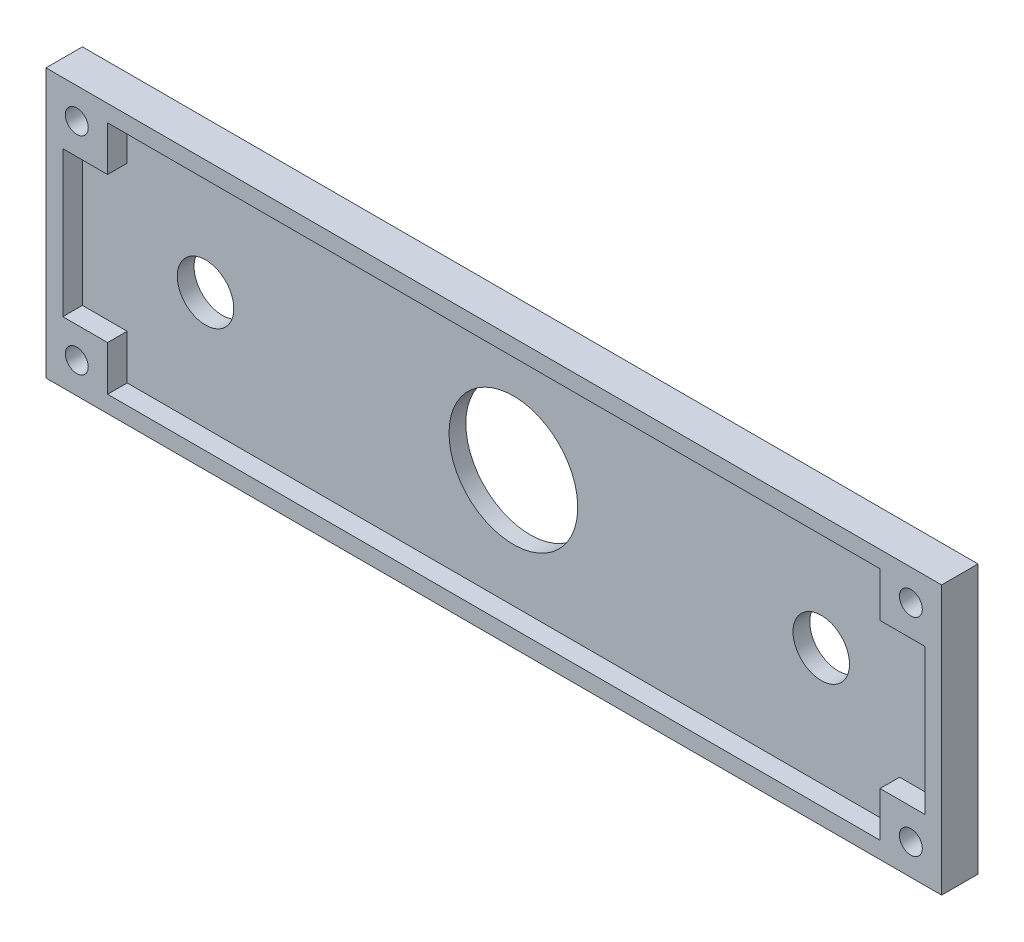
ISO-10303-21;
HEADER;
FILE_DESCRIPTION(('STEP AP214'),'2;1');
FILE_NAME('part.step','',(''),(''),'','','');
FILE_SCHEMA(('AUTOMOTIVE_DESIGN { 1 0 10303 214 1 1 1 1 }'));
ENDSEC;
DATA;
#1=APPLICATION_CONTEXT('core data for automotive mechanical design processes');
#2=APPLICATION_PROTOCOL_DEFINITION('international standard','automotive_design',2000,#1);
#3=PRODUCT_CONTEXT('',#1,'mechanical');
#4=PRODUCT('Part','Part','',(#3));
#5=PRODUCT_RELATED_PRODUCT_CATEGORY('part','',(#4));
#6=PRODUCT_DEFINITION_FORMATION('','',#4);
#7=PRODUCT_DEFINITION_CONTEXT('part definition',#1,'design');
#8=PRODUCT_DEFINITION('design','',#6,#7);
#9=PRODUCT_DEFINITION_SHAPE('','',#8);
#10=(LENGTH_UNIT() NAMED_UNIT(*) SI_UNIT(.MILLI.,.METRE.));
#11=(NAMED_UNIT(*) PLANE_ANGLE_UNIT() SI_UNIT($,.RADIAN.));
#12=(NAMED_UNIT(*) SI_UNIT($,.STERADIAN.) SOLID_ANGLE_UNIT());
#13=UNCERTAINTY_MEASURE_WITH_UNIT(LENGTH_MEASURE(1.E-05),#10,'distance_accuracy_value','');
#14=(GEOMETRIC_REPRESENTATION_CONTEXT(3) GLOBAL_UNCERTAINTY_ASSIGNED_CONTEXT((#13)) GLOBAL_UNIT_ASSIGNED_CONTEXT((#10,
#11,#12)) REPRESENTATION_CONTEXT('',''));
#15=CARTESIAN_POINT('',(0.,0.,0.));
#16=DIRECTION('',(0.,0.,1.));
#17=DIRECTION('',(1.,0.,0.));
#18=AXIS2_PLACEMENT_3D('',#15,#16,#17);
#19=CARTESIAN_POINT('',(73.4437253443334,18.5,10.));
#20=DIRECTION('',(0.,0.,-1.));
#21=DIRECTION('',(-1.,0.,0.));
#22=AXIS2_PLACEMENT_3D('',#19,#20,#21);
#23=CYLINDRICAL_SURFACE('',#22,2.04999999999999);
#24=CARTESIAN_POINT('',(73.4437253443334,18.5,6.5));
#25=DIRECTION('',(0.,0.,1.));
#26=DIRECTION('',(1.,0.,0.));
#27=AXIS2_PLACEMENT_3D('',#24,#25,#26);
#28=CIRCLE('',#27,2.04999999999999);
#29=CARTESIAN_POINT('',(75.4937253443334,18.5,6.5));
#30=VERTEX_POINT('',#29);
#31=EDGE_CURVE('E303',#30,#30,#28,.T.);
#32=ORIENTED_EDGE('',*,*,#31,.T.);
#33=EDGE_LOOP('',(#32));
#34=FACE_BOUND('',#33,.T.);
#35=CARTESIAN_POINT('',(73.4437253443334,18.5,3.5));
#36=DIRECTION('',(0.,0.,-1.));
#37=DIRECTION('',(-1.,0.,0.));
#38=AXIS2_PLACEMENT_3D('',#35,#36,#37);
#39=CIRCLE('',#38,2.04999999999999);
#40=CARTESIAN_POINT('',(71.3937253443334,18.5,3.5));
#41=VERTEX_POINT('',#40);
#42=EDGE_CURVE('E300',#41,#41,#39,.F.);
#43=ORIENTED_EDGE('',*,*,#42,.F.);
#44=EDGE_LOOP('',(#43));
#45=FACE_BOUND('',#44,.T.);
#46=ADVANCED_FACE('F41',(#34,#45),#23,.F.);
#47=CARTESIAN_POINT('',(-75.5562746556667,-18.5,10.));
#48=DIRECTION('',(0.,0.,-1.));
#49=DIRECTION('',(-1.,0.,0.));
#50=AXIS2_PLACEMENT_3D('',#47,#48,#49);
#51=CYLINDRICAL_SURFACE('',#50,2.04999999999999);
#52=CARTESIAN_POINT('',(-75.5562746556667,-18.5,6.5));
#53=DIRECTION('',(0.,0.,1.));
#54=DIRECTION('',(1.,0.,0.));
#55=AXIS2_PLACEMENT_3D('',#52,#53,#54);
#56=CIRCLE('',#55,2.04999999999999);
#57=CARTESIAN_POINT('',(-73.5062746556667,-18.5,6.5));
#58=VERTEX_POINT('',#57);
#59=EDGE_CURVE('E335',#58,#58,#56,.T.);
#60=ORIENTED_EDGE('',*,*,#59,.T.);
#61=EDGE_LOOP('',(#60));
#62=FACE_BOUND('',#61,.T.);
#63=CARTESIAN_POINT('',(-75.5562746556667,-18.5,3.5));
#64=DIRECTION('',(0.,0.,-1.));
#65=DIRECTION('',(-1.,0.,0.));
#66=AXIS2_PLACEMENT_3D('',#63,#64,#65);
#67=CIRCLE('',#66,2.04999999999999);
#68=CARTESIAN_POINT('',(-77.6062746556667,-18.5,3.5));
#69=VERTEX_POINT('',#68);
#70=EDGE_CURVE('E293',#69,#69,#67,.F.);
#71=ORIENTED_EDGE('',*,*,#70,.F.);
#72=EDGE_LOOP('',(#71));
#73=FACE_BOUND('',#72,.T.);
#74=ADVANCED_FACE('F379',(#62,#73),#51,.F.);
#75=CARTESIAN_POINT('',(-81.0562746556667,24.,6.5));
#76=DIRECTION('',(1.,0.,0.));
#77=DIRECTION('',(0.,0.,-1.));
#78=AXIS2_PLACEMENT_3D('',#75,#76,#77);
#79=PLANE('',#78);
#80=DIRECTION('',(0.,-1.,0.));
#81=VECTOR('',#80,1.);
#82=CARTESIAN_POINT('',(-81.0562746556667,24.,0.));
#83=LINE('',#82,#81);
#84=CARTESIAN_POINT('',(-81.0562746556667,24.,0.));
#85=VERTEX_POINT('',#84);
#86=CARTESIAN_POINT('',(-81.0562746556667,-24.,0.));
#87=VERTEX_POINT('',#86);
#88=EDGE_CURVE('E251',#85,#87,#83,.T.);
#89=ORIENTED_EDGE('',*,*,#88,.T.);
#90=DIRECTION('',(0.,0.,-1.));
#91=VECTOR('',#90,1.);
#92=CARTESIAN_POINT('',(-81.0562746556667,-24.,6.5));
#93=LINE('',#92,#91);
#94=CARTESIAN_POINT('',(-81.0562746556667,-24.,6.5));
#95=VERTEX_POINT('',#94);
#96=EDGE_CURVE('E11',#95,#87,#93,.T.);
#97=ORIENTED_EDGE('',*,*,#96,.F.);
#98=DIRECTION('',(0.,-1.,0.));
#99=VECTOR('',#98,1.);
#100=CARTESIAN_POINT('',(-81.0562746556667,24.,6.5));
#101=LINE('',#100,#99);
#102=CARTESIAN_POINT('',(-81.0562746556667,24.,6.5));
#103=VERTEX_POINT('',#102);
#104=EDGE_CURVE('E271',#103,#95,#101,.T.);
#105=ORIENTED_EDGE('',*,*,#104,.F.);
#106=DIRECTION('',(0.,0.,-1.));
#107=VECTOR('',#106,1.);
#108=CARTESIAN_POINT('',(-81.0562746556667,24.,6.5));
#109=LINE('',#108,#107);
#110=EDGE_CURVE('E277',#103,#85,#109,.T.);
#111=ORIENTED_EDGE('',*,*,#110,.T.);
#112=EDGE_LOOP('',(#89,#97,#105,#111));
#113=FACE_BOUND('',#112,.T.);
#114=ADVANCED_FACE('F43',(#113),#79,.F.);
#115=CARTESIAN_POINT('',(-81.0562746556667,-24.,6.5));
#116=DIRECTION('',(0.,1.,0.));
#117=DIRECTION('',(0.,0.,1.));
#118=AXIS2_PLACEMENT_3D('',#115,#116,#117);
#119=PLANE('',#118);
#120=DIRECTION('',(1.,0.,0.));
#121=VECTOR('',#120,1.);
#122=CARTESIAN_POINT('',(-81.0562746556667,-24.,0.));
#123=LINE('',#122,#121);
#124=CARTESIAN_POINT('',(78.9437253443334,-24.,0.));
#125=VERTEX_POINT('',#124);
#126=EDGE_CURVE('E280',#87,#125,#123,.T.);
#127=ORIENTED_EDGE('',*,*,#126,.T.);
#128=DIRECTION('',(0.,0.,-1.));
#129=VECTOR('',#128,1.);
#130=CARTESIAN_POINT('',(78.9437253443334,-24.,6.5));
#131=LINE('',#130,#129);
#132=CARTESIAN_POINT('',(78.9437253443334,-24.,6.5));
#133=VERTEX_POINT('',#132);
#134=EDGE_CURVE('E50',#133,#125,#131,.T.);
#135=ORIENTED_EDGE('',*,*,#134,.F.);
#136=DIRECTION('',(1.,0.,0.));
#137=VECTOR('',#136,1.);
#138=CARTESIAN_POINT('',(-81.0562746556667,-24.,6.5));
#139=LINE('',#138,#137);
#140=EDGE_CURVE('E95',#95,#133,#139,.T.);
#141=ORIENTED_EDGE('',*,*,#140,.F.);
#142=ORIENTED_EDGE('',*,*,#96,.T.);
#143=EDGE_LOOP('',(#127,#135,#141,#142));
#144=FACE_BOUND('',#143,.T.);
#145=ADVANCED_FACE('F360',(#144),#119,.F.);
#146=CARTESIAN_POINT('',(78.9437253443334,24.,6.5));
#147=DIRECTION('',(-1.,0.,0.));
#148=DIRECTION('',(0.,0.,1.));
#149=AXIS2_PLACEMENT_3D('',#146,#147,#148);
#150=PLANE('',#149);
#151=DIRECTION('',(0.,1.,0.));
#152=VECTOR('',#151,1.);
#153=CARTESIAN_POINT('',(78.9437253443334,24.,0.));
#154=LINE('',#153,#152);
#155=CARTESIAN_POINT('',(78.9437253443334,24.,0.));
#156=VERTEX_POINT('',#155);
#157=EDGE_CURVE('E282',#125,#156,#154,.T.);
#158=ORIENTED_EDGE('',*,*,#157,.T.);
#159=DIRECTION('',(0.,0.,-1.));
#160=VECTOR('',#159,1.);
#161=CARTESIAN_POINT('',(78.9437253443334,24.,6.5));
#162=LINE('',#161,#160);
#163=CARTESIAN_POINT('',(78.9437253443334,24.,6.5));
#164=VERTEX_POINT('',#163);
#165=EDGE_CURVE('E286',#164,#156,#162,.T.);
#166=ORIENTED_EDGE('',*,*,#165,.F.);
#167=DIRECTION('',(0.,1.,0.));
#168=VECTOR('',#167,1.);
#169=CARTESIAN_POINT('',(78.9437253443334,24.,6.5));
#170=LINE('',#169,#168);
#171=EDGE_CURVE('E274',#133,#164,#170,.T.);
#172=ORIENTED_EDGE('',*,*,#171,.F.);
#173=ORIENTED_EDGE('',*,*,#134,.T.);
#174=EDGE_LOOP('',(#158,#166,#172,#173));
#175=FACE_BOUND('',#174,.T.);
#176=ADVANCED_FACE('F365',(#175),#150,.F.);
#177=CARTESIAN_POINT('',(-81.0562746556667,24.,6.5));
#178=DIRECTION('',(0.,-1.,0.));
#179=DIRECTION('',(0.,0.,-1.));
#180=AXIS2_PLACEMENT_3D('',#177,#178,#179);
#181=PLANE('',#180);
#182=DIRECTION('',(-1.,0.,0.));
#183=VECTOR('',#182,1.);
#184=CARTESIAN_POINT('',(-81.0562746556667,24.,0.));
#185=LINE('',#184,#183);
#186=EDGE_CURVE('E88',#156,#85,#185,.T.);
#187=ORIENTED_EDGE('',*,*,#186,.T.);
#188=ORIENTED_EDGE('',*,*,#110,.F.);
#189=DIRECTION('',(-1.,0.,0.));
#190=VECTOR('',#189,1.);
#191=CARTESIAN_POINT('',(-81.0562746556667,24.,6.5));
#192=LINE('',#191,#190);
#193=EDGE_CURVE('E67',#164,#103,#192,.T.);
#194=ORIENTED_EDGE('',*,*,#193,.F.);
#195=ORIENTED_EDGE('',*,*,#165,.T.);
#196=EDGE_LOOP('',(#187,#188,#194,#195));
#197=FACE_BOUND('',#196,.T.);
#198=ADVANCED_FACE('F348',(#197),#181,.F.);
#199=CARTESIAN_POINT('',(0.,0.,6.5));
#200=DIRECTION('',(0.,0.,1.));
#201=DIRECTION('',(1.,0.,0.));
#202=AXIS2_PLACEMENT_3D('',#199,#200,#201);
#203=PLANE('',#202);
#204=CARTESIAN_POINT('',(73.4437253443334,-18.5,6.5));
#205=DIRECTION('',(0.,0.,1.));
#206=DIRECTION('',(1.,0.,0.));
#207=AXIS2_PLACEMENT_3D('',#204,#205,#206);
#208=CIRCLE('',#207,2.04999999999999);
#209=CARTESIAN_POINT('',(75.4937253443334,-18.5,6.5));
#210=VERTEX_POINT('',#209);
#211=EDGE_CURVE('E192',#210,#210,#208,.T.);
#212=ORIENTED_EDGE('',*,*,#211,.F.);
#213=EDGE_LOOP('',(#212));
#214=FACE_BOUND('',#213,.T.);
#215=ORIENTED_EDGE('',*,*,#59,.F.);
#216=EDGE_LOOP('',(#215));
#217=FACE_BOUND('',#216,.T.);
#218=CARTESIAN_POINT('',(-75.5562746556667,18.5,6.5));
#219=DIRECTION('',(0.,0.,1.));
#220=DIRECTION('',(1.,0.,0.));
#221=AXIS2_PLACEMENT_3D('',#218,#219,#220);
#222=CIRCLE('',#221,2.04999999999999);
#223=CARTESIAN_POINT('',(-73.5062746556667,18.5,6.5));
#224=VERTEX_POINT('',#223);
#225=EDGE_CURVE('E333',#224,#224,#222,.T.);
#226=ORIENTED_EDGE('',*,*,#225,.F.);
#227=EDGE_LOOP('',(#226));
#228=FACE_BOUND('',#227,.T.);
#229=ORIENTED_EDGE('',*,*,#31,.F.);
#230=EDGE_LOOP('',(#229));
#231=FACE_BOUND('',#230,.T.);
#232=DIRECTION('',(0.,-1.,0.));
#233=VECTOR('',#232,1.);
#234=CARTESIAN_POINT('',(-70.0562746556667,21.,6.5));
#235=LINE('',#234,#233);
#236=CARTESIAN_POINT('',(-70.0562746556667,21.,6.5));
#237=VERTEX_POINT('',#236);
#238=CARTESIAN_POINT('',(-70.0562746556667,13.,6.5));
#239=VERTEX_POINT('',#238);
#240=EDGE_CURVE('E58',#237,#239,#235,.T.);
#241=ORIENTED_EDGE('',*,*,#240,.F.);
#242=DIRECTION('',(-1.,0.,0.));
#243=VECTOR('',#242,1.);
#244=CARTESIAN_POINT('',(-70.0562746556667,21.,6.5));
#245=LINE('',#244,#243);
#246=CARTESIAN_POINT('',(67.9437253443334,21.,6.5));
#247=VERTEX_POINT('',#246);
#248=EDGE_CURVE('E186',#247,#237,#245,.T.);
#249=ORIENTED_EDGE('',*,*,#248,.F.);
#250=DIRECTION('',(0.,1.,0.));
#251=VECTOR('',#250,1.);
#252=CARTESIAN_POINT('',(67.9437253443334,21.,6.5));
#253=LINE('',#252,#251);
#254=CARTESIAN_POINT('',(67.9437253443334,13.,6.5));
#255=VERTEX_POINT('',#254);
#256=EDGE_CURVE('E189',#255,#247,#253,.T.);
#257=ORIENTED_EDGE('',*,*,#256,.F.);
#258=DIRECTION('',(-1.,0.,0.));
#259=VECTOR('',#258,1.);
#260=CARTESIAN_POINT('',(67.9437253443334,13.,6.5));
#261=LINE('',#260,#259);
#262=CARTESIAN_POINT('',(75.9437253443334,13.,6.5));
#263=VERTEX_POINT('',#262);
#264=EDGE_CURVE('E244',#263,#255,#261,.T.);
#265=ORIENTED_EDGE('',*,*,#264,.F.);
#266=DIRECTION('',(0.,1.,0.));
#267=VECTOR('',#266,1.);
#268=CARTESIAN_POINT('',(75.9437253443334,13.,6.5));
#269=LINE('',#268,#267);
#270=CARTESIAN_POINT('',(75.9437253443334,-13.,6.5));
#271=VERTEX_POINT('',#270);
#272=EDGE_CURVE('E241',#271,#263,#269,.T.);
#273=ORIENTED_EDGE('',*,*,#272,.F.);
#274=DIRECTION('',(1.,0.,0.));
#275=VECTOR('',#274,1.);
#276=CARTESIAN_POINT('',(67.9437253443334,-13.,6.5));
#277=LINE('',#276,#275);
#278=CARTESIAN_POINT('',(67.9437253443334,-13.,6.5));
#279=VERTEX_POINT('',#278);
#280=EDGE_CURVE('E238',#279,#271,#277,.T.);
#281=ORIENTED_EDGE('',*,*,#280,.F.);
#282=DIRECTION('',(0.,1.,0.));
#283=VECTOR('',#282,1.);
#284=CARTESIAN_POINT('',(67.9437253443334,-21.,6.5));
#285=LINE('',#284,#283);
#286=CARTESIAN_POINT('',(67.9437253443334,-21.,6.5));
#287=VERTEX_POINT('',#286);
#288=EDGE_CURVE('E235',#287,#279,#285,.T.);
#289=ORIENTED_EDGE('',*,*,#288,.F.);
#290=DIRECTION('',(1.,0.,0.));
#291=VECTOR('',#290,1.);
#292=CARTESIAN_POINT('',(-70.0562746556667,-21.,6.5));
#293=LINE('',#292,#291);
#294=CARTESIAN_POINT('',(-70.0562746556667,-21.,6.5));
#295=VERTEX_POINT('',#294);
#296=EDGE_CURVE('E232',#295,#287,#293,.T.);
#297=ORIENTED_EDGE('',*,*,#296,.F.);
#298=DIRECTION('',(0.,-1.,0.));
#299=VECTOR('',#298,1.);
#300=CARTESIAN_POINT('',(-70.0562746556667,-13.,6.5));
#301=LINE('',#300,#299);
#302=CARTESIAN_POINT('',(-70.0562746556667,-13.,6.5));
#303=VERTEX_POINT('',#302);
#304=EDGE_CURVE('E229',#303,#295,#301,.T.);
#305=ORIENTED_EDGE('',*,*,#304,.F.);
#306=DIRECTION('',(1.,0.,0.));
#307=VECTOR('',#306,1.);
#308=CARTESIAN_POINT('',(-78.0562746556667,-13.,6.5));
#309=LINE('',#308,#307);
#310=CARTESIAN_POINT('',(-78.0562746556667,-13.,6.5));
#311=VERTEX_POINT('',#310);
#312=EDGE_CURVE('E226',#311,#303,#309,.T.);
#313=ORIENTED_EDGE('',*,*,#312,.F.);
#314=DIRECTION('',(0.,-1.,0.));
#315=VECTOR('',#314,1.);
#316=CARTESIAN_POINT('',(-78.0562746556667,13.,6.5));
#317=LINE('',#316,#315);
#318=CARTESIAN_POINT('',(-78.0562746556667,13.,6.5));
#319=VERTEX_POINT('',#318);
#320=EDGE_CURVE('E223',#319,#311,#317,.T.);
#321=ORIENTED_EDGE('',*,*,#320,.F.);
#322=DIRECTION('',(-1.,0.,0.));
#323=VECTOR('',#322,1.);
#324=CARTESIAN_POINT('',(-70.0562746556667,13.,6.5));
#325=LINE('',#324,#323);
#326=EDGE_CURVE('E221',#239,#319,#325,.T.);
#327=ORIENTED_EDGE('',*,*,#326,.F.);
#328=EDGE_LOOP('',(#241,#249,#257,#265,#273,#281,#289,#297,#305,#313,#321,#327));
#329=FACE_BOUND('',#328,.T.);
#330=ORIENTED_EDGE('',*,*,#104,.T.);
#331=ORIENTED_EDGE('',*,*,#140,.T.);
#332=ORIENTED_EDGE('',*,*,#171,.T.);
#333=ORIENTED_EDGE('',*,*,#193,.T.);
#334=EDGE_LOOP('',(#330,#331,#332,#333));
#335=FACE_BOUND('',#334,.T.);
#336=ADVANCED_FACE('F344',(#214,#217,#228,#231,#329,#335),#203,.T.);
#337=CARTESIAN_POINT('',(0.,0.,0.));
#338=DIRECTION('',(0.,0.,1.));
#339=DIRECTION('',(1.,0.,0.));
#340=AXIS2_PLACEMENT_3D('',#337,#338,#339);
#341=PLANE('',#340);
#342=CARTESIAN_POINT('',(-56.0562746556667,0.,0.));
#343=DIRECTION('',(0.,0.,-1.));
#344=DIRECTION('',(1.,0.,0.));
#345=AXIS2_PLACEMENT_3D('',#342,#343,#344);
#346=CIRCLE('',#345,5.05);
#347=CARTESIAN_POINT('',(-51.0062746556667,0.,0.));
#348=VERTEX_POINT('',#347);
#349=EDGE_CURVE('E755',#348,#348,#346,.T.);
#350=ORIENTED_EDGE('',*,*,#349,.F.);
#351=EDGE_LOOP('',(#350));
#352=FACE_BOUND('',#351,.T.);
#353=CARTESIAN_POINT('',(53.9437253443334,0.,0.));
#354=DIRECTION('',(0.,0.,-1.));
#355=DIRECTION('',(-1.,0.,0.));
#356=AXIS2_PLACEMENT_3D('',#353,#354,#355);
#357=CIRCLE('',#356,5.05);
#358=CARTESIAN_POINT('',(48.8937253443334,0.,0.));
#359=VERTEX_POINT('',#358);
#360=EDGE_CURVE('E756',#359,#359,#357,.T.);
#361=ORIENTED_EDGE('',*,*,#360,.F.);
#362=EDGE_LOOP('',(#361));
#363=FACE_BOUND('',#362,.T.);
#364=CARTESIAN_POINT('',(-1.05627465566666,0.,0.));
#365=DIRECTION('',(0.,0.,-1.));
#366=DIRECTION('',(-1.,0.,0.));
#367=AXIS2_PLACEMENT_3D('',#364,#365,#366);
#368=CIRCLE('',#367,11.5);
#369=CARTESIAN_POINT('',(-12.5562746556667,0.,0.));
#370=VERTEX_POINT('',#369);
#371=EDGE_CURVE('E307',#370,#370,#368,.T.);
#372=ORIENTED_EDGE('',*,*,#371,.F.);
#373=EDGE_LOOP('',(#372));
#374=FACE_BOUND('',#373,.T.);
#375=CARTESIAN_POINT('',(73.4437253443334,-18.5,0.));
#376=DIRECTION('',(0.,0.,-1.));
#377=DIRECTION('',(1.,0.,0.));
#378=AXIS2_PLACEMENT_3D('',#375,#376,#377);
#379=CIRCLE('',#378,4.00000000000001);
#380=CARTESIAN_POINT('',(77.4437253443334,-18.5,0.));
#381=VERTEX_POINT('',#380);
#382=EDGE_CURVE('E316',#381,#381,#379,.T.);
#383=ORIENTED_EDGE('',*,*,#382,.F.);
#384=EDGE_LOOP('',(#383));
#385=FACE_BOUND('',#384,.T.);
#386=CARTESIAN_POINT('',(-75.5562746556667,-18.5,0.));
#387=DIRECTION('',(0.,0.,-1.));
#388=DIRECTION('',(-1.,0.,0.));
#389=AXIS2_PLACEMENT_3D('',#386,#387,#388);
#390=CIRCLE('',#389,4.00000000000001);
#391=CARTESIAN_POINT('',(-79.5562746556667,-18.5,0.));
#392=VERTEX_POINT('',#391);
#393=EDGE_CURVE('E768',#392,#392,#390,.T.);
#394=ORIENTED_EDGE('',*,*,#393,.F.);
#395=EDGE_LOOP('',(#394));
#396=FACE_BOUND('',#395,.T.);
#397=CARTESIAN_POINT('',(-75.5562746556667,18.5,0.));
#398=DIRECTION('',(0.,0.,-1.));
#399=DIRECTION('',(1.,0.,0.));
#400=AXIS2_PLACEMENT_3D('',#397,#398,#399);
#401=CIRCLE('',#400,4.00000000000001);
#402=CARTESIAN_POINT('',(-71.5562746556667,18.5,0.));
#403=VERTEX_POINT('',#402);
#404=EDGE_CURVE('E330',#403,#403,#401,.T.);
#405=ORIENTED_EDGE('',*,*,#404,.F.);
#406=EDGE_LOOP('',(#405));
#407=FACE_BOUND('',#406,.T.);
#408=CARTESIAN_POINT('',(73.4437253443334,18.5,0.));
#409=DIRECTION('',(0.,0.,-1.));
#410=DIRECTION('',(-1.,0.,0.));
#411=AXIS2_PLACEMENT_3D('',#408,#409,#410);
#412=CIRCLE('',#411,4.00000000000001);
#413=CARTESIAN_POINT('',(69.4437253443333,18.5,0.));
#414=VERTEX_POINT('',#413);
#415=EDGE_CURVE('E327',#414,#414,#412,.T.);
#416=ORIENTED_EDGE('',*,*,#415,.F.);
#417=EDGE_LOOP('',(#416));
#418=FACE_BOUND('',#417,.T.);
#419=ORIENTED_EDGE('',*,*,#88,.F.);
#420=ORIENTED_EDGE('',*,*,#186,.F.);
#421=ORIENTED_EDGE('',*,*,#157,.F.);
#422=ORIENTED_EDGE('',*,*,#126,.F.);
#423=EDGE_LOOP('',(#419,#420,#421,#422));
#424=FACE_BOUND('',#423,.T.);
#425=ADVANCED_FACE('F347',(#352,#363,#374,#385,#396,#407,#418,#424),#341,.F.);
#426=CARTESIAN_POINT('',(-70.0562746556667,21.,3.));
#427=DIRECTION('',(-1.,0.,0.));
#428=DIRECTION('',(0.,0.,1.));
#429=AXIS2_PLACEMENT_3D('',#426,#427,#428);
#430=PLANE('',#429);
#431=ORIENTED_EDGE('',*,*,#240,.T.);
#432=DIRECTION('',(0.,0.,1.));
#433=VECTOR('',#432,1.);
#434=CARTESIAN_POINT('',(-70.0562746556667,13.,3.));
#435=LINE('',#434,#433);
#436=CARTESIAN_POINT('',(-70.0562746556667,13.,3.));
#437=VERTEX_POINT('',#436);
#438=EDGE_CURVE('E163',#437,#239,#435,.T.);
#439=ORIENTED_EDGE('',*,*,#438,.F.);
#440=DIRECTION('',(0.,-1.,0.));
#441=VECTOR('',#440,1.);
#442=CARTESIAN_POINT('',(-70.0562746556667,21.,3.));
#443=LINE('',#442,#441);
#444=CARTESIAN_POINT('',(-70.0562746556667,21.,3.));
#445=VERTEX_POINT('',#444);
#446=EDGE_CURVE('E167',#445,#437,#443,.T.);
#447=ORIENTED_EDGE('',*,*,#446,.F.);
#448=DIRECTION('',(0.,0.,1.));
#449=VECTOR('',#448,1.);
#450=CARTESIAN_POINT('',(-70.0562746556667,21.,3.));
#451=LINE('',#450,#449);
#452=EDGE_CURVE('E249',#445,#237,#451,.T.);
#453=ORIENTED_EDGE('',*,*,#452,.T.);
#454=EDGE_LOOP('',(#431,#439,#447,#453));
#455=FACE_BOUND('',#454,.T.);
#456=ADVANCED_FACE('F165',(#455),#430,.F.);
#457=CARTESIAN_POINT('',(-70.0562746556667,21.,3.));
#458=DIRECTION('',(0.,1.,0.));
#459=DIRECTION('',(0.,0.,1.));
#460=AXIS2_PLACEMENT_3D('',#457,#458,#459);
#461=PLANE('',#460);
#462=ORIENTED_EDGE('',*,*,#248,.T.);
#463=ORIENTED_EDGE('',*,*,#452,.F.);
#464=DIRECTION('',(-1.,0.,0.));
#465=VECTOR('',#464,1.);
#466=CARTESIAN_POINT('',(-70.0562746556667,21.,3.));
#467=LINE('',#466,#465);
#468=CARTESIAN_POINT('',(67.9437253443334,21.,3.));
#469=VERTEX_POINT('',#468);
#470=EDGE_CURVE('E173',#469,#445,#467,.T.);
#471=ORIENTED_EDGE('',*,*,#470,.F.);
#472=DIRECTION('',(0.,0.,1.));
#473=VECTOR('',#472,1.);
#474=CARTESIAN_POINT('',(67.9437253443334,21.,3.));
#475=LINE('',#474,#473);
#476=EDGE_CURVE('E252',#469,#247,#475,.T.);
#477=ORIENTED_EDGE('',*,*,#476,.T.);
#478=EDGE_LOOP('',(#462,#463,#471,#477));
#479=FACE_BOUND('',#478,.T.);
#480=ADVANCED_FACE('F373',(#479),#461,.F.);
#481=CARTESIAN_POINT('',(67.9437253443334,21.,3.));
#482=DIRECTION('',(1.,0.,0.));
#483=DIRECTION('',(0.,0.,-1.));
#484=AXIS2_PLACEMENT_3D('',#481,#482,#483);
#485=PLANE('',#484);
#486=ORIENTED_EDGE('',*,*,#256,.T.);
#487=ORIENTED_EDGE('',*,*,#476,.F.);
#488=DIRECTION('',(0.,1.,0.));
#489=VECTOR('',#488,1.);
#490=CARTESIAN_POINT('',(67.9437253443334,21.,3.));
#491=LINE('',#490,#489);
#492=CARTESIAN_POINT('',(67.9437253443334,13.,3.));
#493=VERTEX_POINT('',#492);
#494=EDGE_CURVE('E217',#493,#469,#491,.T.);
#495=ORIENTED_EDGE('',*,*,#494,.F.);
#496=DIRECTION('',(0.,0.,1.));
#497=VECTOR('',#496,1.);
#498=CARTESIAN_POINT('',(67.9437253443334,13.,3.));
#499=LINE('',#498,#497);
#500=EDGE_CURVE('E254',#493,#255,#499,.T.);
#501=ORIENTED_EDGE('',*,*,#500,.T.);
#502=EDGE_LOOP('',(#486,#487,#495,#501));
#503=FACE_BOUND('',#502,.T.);
#504=ADVANCED_FACE('F394',(#503),#485,.F.);
#505=CARTESIAN_POINT('',(67.9437253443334,13.,3.));
#506=DIRECTION('',(0.,1.,0.));
#507=DIRECTION('',(0.,0.,1.));
#508=AXIS2_PLACEMENT_3D('',#505,#506,#507);
#509=PLANE('',#508);
#510=ORIENTED_EDGE('',*,*,#264,.T.);
#511=ORIENTED_EDGE('',*,*,#500,.F.);
#512=DIRECTION('',(-1.,0.,0.));
#513=VECTOR('',#512,1.);
#514=CARTESIAN_POINT('',(67.9437253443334,13.,3.));
#515=LINE('',#514,#513);
#516=CARTESIAN_POINT('',(75.9437253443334,13.,3.));
#517=VERTEX_POINT('',#516);
#518=EDGE_CURVE('E214',#517,#493,#515,.T.);
#519=ORIENTED_EDGE('',*,*,#518,.F.);
#520=DIRECTION('',(0.,0.,1.));
#521=VECTOR('',#520,1.);
#522=CARTESIAN_POINT('',(75.9437253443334,13.,3.));
#523=LINE('',#522,#521);
#524=EDGE_CURVE('E256',#517,#263,#523,.T.);
#525=ORIENTED_EDGE('',*,*,#524,.T.);
#526=EDGE_LOOP('',(#510,#511,#519,#525));
#527=FACE_BOUND('',#526,.T.);
#528=ADVANCED_FACE('F398',(#527),#509,.F.);
#529=CARTESIAN_POINT('',(75.9437253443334,13.,3.));
#530=DIRECTION('',(1.,0.,0.));
#531=DIRECTION('',(0.,0.,-1.));
#532=AXIS2_PLACEMENT_3D('',#529,#530,#531);
#533=PLANE('',#532);
#534=ORIENTED_EDGE('',*,*,#272,.T.);
#535=ORIENTED_EDGE('',*,*,#524,.F.);
#536=DIRECTION('',(0.,1.,0.));
#537=VECTOR('',#536,1.);
#538=CARTESIAN_POINT('',(75.9437253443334,13.,3.));
#539=LINE('',#538,#537);
#540=CARTESIAN_POINT('',(75.9437253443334,-13.,3.));
#541=VERTEX_POINT('',#540);
#542=EDGE_CURVE('E211',#541,#517,#539,.T.);
#543=ORIENTED_EDGE('',*,*,#542,.F.);
#544=DIRECTION('',(0.,0.,1.));
#545=VECTOR('',#544,1.);
#546=CARTESIAN_POINT('',(75.9437253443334,-13.,3.));
#547=LINE('',#546,#545);
#548=EDGE_CURVE('E258',#541,#271,#547,.T.);
#549=ORIENTED_EDGE('',*,*,#548,.T.);
#550=EDGE_LOOP('',(#534,#535,#543,#549));
#551=FACE_BOUND('',#550,.T.);
#552=ADVANCED_FACE('F402',(#551),#533,.F.);
#553=CARTESIAN_POINT('',(67.9437253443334,-13.,3.));
#554=DIRECTION('',(0.,-1.,0.));
#555=DIRECTION('',(0.,0.,-1.));
#556=AXIS2_PLACEMENT_3D('',#553,#554,#555);
#557=PLANE('',#556);
#558=ORIENTED_EDGE('',*,*,#280,.T.);
#559=ORIENTED_EDGE('',*,*,#548,.F.);
#560=DIRECTION('',(1.,0.,0.));
#561=VECTOR('',#560,1.);
#562=CARTESIAN_POINT('',(67.9437253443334,-13.,3.));
#563=LINE('',#562,#561);
#564=CARTESIAN_POINT('',(67.9437253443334,-13.,3.));
#565=VERTEX_POINT('',#564);
#566=EDGE_CURVE('E208',#565,#541,#563,.T.);
#567=ORIENTED_EDGE('',*,*,#566,.F.);
#568=DIRECTION('',(0.,0.,1.));
#569=VECTOR('',#568,1.);
#570=CARTESIAN_POINT('',(67.9437253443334,-13.,3.));
#571=LINE('',#570,#569);
#572=EDGE_CURVE('E260',#565,#279,#571,.T.);
#573=ORIENTED_EDGE('',*,*,#572,.T.);
#574=EDGE_LOOP('',(#558,#559,#567,#573));
#575=FACE_BOUND('',#574,.T.);
#576=ADVANCED_FACE('F406',(#575),#557,.F.);
#577=CARTESIAN_POINT('',(67.9437253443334,-21.,3.));
#578=DIRECTION('',(1.,0.,0.));
#579=DIRECTION('',(0.,0.,-1.));
#580=AXIS2_PLACEMENT_3D('',#577,#578,#579);
#581=PLANE('',#580);
#582=ORIENTED_EDGE('',*,*,#288,.T.);
#583=ORIENTED_EDGE('',*,*,#572,.F.);
#584=DIRECTION('',(0.,1.,0.));
#585=VECTOR('',#584,1.);
#586=CARTESIAN_POINT('',(67.9437253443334,-21.,3.));
#587=LINE('',#586,#585);
#588=CARTESIAN_POINT('',(67.9437253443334,-21.,3.));
#589=VERTEX_POINT('',#588);
#590=EDGE_CURVE('E205',#589,#565,#587,.T.);
#591=ORIENTED_EDGE('',*,*,#590,.F.);
#592=DIRECTION('',(0.,0.,1.));
#593=VECTOR('',#592,1.);
#594=CARTESIAN_POINT('',(67.9437253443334,-21.,3.));
#595=LINE('',#594,#593);
#596=EDGE_CURVE('E262',#589,#287,#595,.T.);
#597=ORIENTED_EDGE('',*,*,#596,.T.);
#598=EDGE_LOOP('',(#582,#583,#591,#597));
#599=FACE_BOUND('',#598,.T.);
#600=ADVANCED_FACE('F410',(#599),#581,.F.);
#601=CARTESIAN_POINT('',(-70.0562746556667,-21.,3.));
#602=DIRECTION('',(0.,-1.,0.));
#603=DIRECTION('',(0.,0.,-1.));
#604=AXIS2_PLACEMENT_3D('',#601,#602,#603);
#605=PLANE('',#604);
#606=ORIENTED_EDGE('',*,*,#296,.T.);
#607=ORIENTED_EDGE('',*,*,#596,.F.);
#608=DIRECTION('',(1.,0.,0.));
#609=VECTOR('',#608,1.);
#610=CARTESIAN_POINT('',(-70.0562746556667,-21.,3.));
#611=LINE('',#610,#609);
#612=CARTESIAN_POINT('',(-70.0562746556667,-21.,3.));
#613=VERTEX_POINT('',#612);
#614=EDGE_CURVE('E202',#613,#589,#611,.T.);
#615=ORIENTED_EDGE('',*,*,#614,.F.);
#616=DIRECTION('',(0.,0.,1.));
#617=VECTOR('',#616,1.);
#618=CARTESIAN_POINT('',(-70.0562746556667,-21.,3.));
#619=LINE('',#618,#617);
#620=EDGE_CURVE('E264',#613,#295,#619,.T.);
#621=ORIENTED_EDGE('',*,*,#620,.T.);
#622=EDGE_LOOP('',(#606,#607,#615,#621));
#623=FACE_BOUND('',#622,.T.);
#624=ADVANCED_FACE('F414',(#623),#605,.F.);
#625=CARTESIAN_POINT('',(-70.0562746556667,-13.,3.));
#626=DIRECTION('',(-1.,0.,0.));
#627=DIRECTION('',(0.,0.,1.));
#628=AXIS2_PLACEMENT_3D('',#625,#626,#627);
#629=PLANE('',#628);
#630=ORIENTED_EDGE('',*,*,#304,.T.);
#631=ORIENTED_EDGE('',*,*,#620,.F.);
#632=DIRECTION('',(0.,-1.,0.));
#633=VECTOR('',#632,1.);
#634=CARTESIAN_POINT('',(-70.0562746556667,-13.,3.));
#635=LINE('',#634,#633);
#636=CARTESIAN_POINT('',(-70.0562746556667,-13.,3.));
#637=VERTEX_POINT('',#636);
#638=EDGE_CURVE('E199',#637,#613,#635,.T.);
#639=ORIENTED_EDGE('',*,*,#638,.F.);
#640=DIRECTION('',(0.,0.,1.));
#641=VECTOR('',#640,1.);
#642=CARTESIAN_POINT('',(-70.0562746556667,-13.,3.));
#643=LINE('',#642,#641);
#644=EDGE_CURVE('E266',#637,#303,#643,.T.);
#645=ORIENTED_EDGE('',*,*,#644,.T.);
#646=EDGE_LOOP('',(#630,#631,#639,#645));
#647=FACE_BOUND('',#646,.T.);
#648=ADVANCED_FACE('F418',(#647),#629,.F.);
#649=CARTESIAN_POINT('',(-78.0562746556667,-13.,3.));
#650=DIRECTION('',(0.,-1.,0.));
#651=DIRECTION('',(0.,0.,-1.));
#652=AXIS2_PLACEMENT_3D('',#649,#650,#651);
#653=PLANE('',#652);
#654=ORIENTED_EDGE('',*,*,#312,.T.);
#655=ORIENTED_EDGE('',*,*,#644,.F.);
#656=DIRECTION('',(1.,0.,0.));
#657=VECTOR('',#656,1.);
#658=CARTESIAN_POINT('',(-78.0562746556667,-13.,3.));
#659=LINE('',#658,#657);
#660=CARTESIAN_POINT('',(-78.0562746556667,-13.,3.));
#661=VERTEX_POINT('',#660);
#662=EDGE_CURVE('E196',#661,#637,#659,.T.);
#663=ORIENTED_EDGE('',*,*,#662,.F.);
#664=DIRECTION('',(0.,0.,1.));
#665=VECTOR('',#664,1.);
#666=CARTESIAN_POINT('',(-78.0562746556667,-13.,3.));
#667=LINE('',#666,#665);
#668=EDGE_CURVE('E268',#661,#311,#667,.T.);
#669=ORIENTED_EDGE('',*,*,#668,.T.);
#670=EDGE_LOOP('',(#654,#655,#663,#669));
#671=FACE_BOUND('',#670,.T.);
#672=ADVANCED_FACE('F422',(#671),#653,.F.);
#673=CARTESIAN_POINT('',(-78.0562746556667,13.,3.));
#674=DIRECTION('',(-1.,0.,0.));
#675=DIRECTION('',(0.,0.,1.));
#676=AXIS2_PLACEMENT_3D('',#673,#674,#675);
#677=PLANE('',#676);
#678=ORIENTED_EDGE('',*,*,#320,.T.);
#679=ORIENTED_EDGE('',*,*,#668,.F.);
#680=DIRECTION('',(0.,-1.,0.));
#681=VECTOR('',#680,1.);
#682=CARTESIAN_POINT('',(-78.0562746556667,13.,3.));
#683=LINE('',#682,#681);
#684=CARTESIAN_POINT('',(-78.0562746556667,13.,3.));
#685=VERTEX_POINT('',#684);
#686=EDGE_CURVE('E181',#685,#661,#683,.T.);
#687=ORIENTED_EDGE('',*,*,#686,.F.);
#688=DIRECTION('',(0.,0.,1.));
#689=VECTOR('',#688,1.);
#690=CARTESIAN_POINT('',(-78.0562746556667,13.,3.));
#691=LINE('',#690,#689);
#692=EDGE_CURVE('E172',#685,#319,#691,.T.);
#693=ORIENTED_EDGE('',*,*,#692,.T.);
#694=EDGE_LOOP('',(#678,#679,#687,#693));
#695=FACE_BOUND('',#694,.T.);
#696=ADVANCED_FACE('F426',(#695),#677,.F.);
#697=CARTESIAN_POINT('',(-70.0562746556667,13.,3.));
#698=DIRECTION('',(0.,1.,0.));
#699=DIRECTION('',(-1.,0.,0.));
#700=AXIS2_PLACEMENT_3D('',#697,#698,#699);
#701=PLANE('',#700);
#702=ORIENTED_EDGE('',*,*,#326,.T.);
#703=ORIENTED_EDGE('',*,*,#692,.F.);
#704=DIRECTION('',(-1.,0.,0.));
#705=VECTOR('',#704,1.);
#706=CARTESIAN_POINT('',(-70.0562746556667,13.,3.));
#707=LINE('',#706,#705);
#708=EDGE_CURVE('E176',#437,#685,#707,.T.);
#709=ORIENTED_EDGE('',*,*,#708,.F.);
#710=ORIENTED_EDGE('',*,*,#438,.T.);
#711=EDGE_LOOP('',(#702,#703,#709,#710));
#712=FACE_BOUND('',#711,.T.);
#713=ADVANCED_FACE('F177',(#712),#701,.F.);
#714=CARTESIAN_POINT('',(0.,0.,3.));
#715=DIRECTION('',(0.,0.,-1.));
#716=DIRECTION('',(-1.,0.,0.));
#717=AXIS2_PLACEMENT_3D('',#714,#715,#716);
#718=PLANE('',#717);
#719=CARTESIAN_POINT('',(-56.0562746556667,0.,3.));
#720=DIRECTION('',(0.,0.,-1.));
#721=DIRECTION('',(-1.,0.,0.));
#722=AXIS2_PLACEMENT_3D('',#719,#720,#721);
#723=CIRCLE('',#722,5.05);
#724=CARTESIAN_POINT('',(-61.1062746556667,0.,3.));
#725=VERTEX_POINT('',#724);
#726=EDGE_CURVE('E45',#725,#725,#723,.T.);
#727=ORIENTED_EDGE('',*,*,#726,.T.);
#728=EDGE_LOOP('',(#727));
#729=FACE_BOUND('',#728,.T.);
#730=CARTESIAN_POINT('',(53.9437253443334,0.,3.));
#731=DIRECTION('',(0.,0.,-1.));
#732=DIRECTION('',(-1.,0.,0.));
#733=AXIS2_PLACEMENT_3D('',#730,#731,#732);
#734=CIRCLE('',#733,5.05);
#735=CARTESIAN_POINT('',(48.8937253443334,0.,3.));
#736=VERTEX_POINT('',#735);
#737=EDGE_CURVE('E306',#736,#736,#734,.T.);
#738=ORIENTED_EDGE('',*,*,#737,.T.);
#739=EDGE_LOOP('',(#738));
#740=FACE_BOUND('',#739,.T.);
#741=CARTESIAN_POINT('',(-1.05627465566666,0.,3.));
#742=DIRECTION('',(0.,0.,-1.));
#743=DIRECTION('',(-1.,0.,0.));
#744=AXIS2_PLACEMENT_3D('',#741,#742,#743);
#745=CIRCLE('',#744,11.5);
#746=CARTESIAN_POINT('',(-12.5562746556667,0.,3.));
#747=VERTEX_POINT('',#746);
#748=EDGE_CURVE('E304',#747,#747,#745,.T.);
#749=ORIENTED_EDGE('',*,*,#748,.T.);
#750=EDGE_LOOP('',(#749));
#751=FACE_BOUND('',#750,.T.);
#752=ORIENTED_EDGE('',*,*,#446,.T.);
#753=ORIENTED_EDGE('',*,*,#708,.T.);
#754=ORIENTED_EDGE('',*,*,#686,.T.);
#755=ORIENTED_EDGE('',*,*,#662,.T.);
#756=ORIENTED_EDGE('',*,*,#638,.T.);
#757=ORIENTED_EDGE('',*,*,#614,.T.);
#758=ORIENTED_EDGE('',*,*,#590,.T.);
#759=ORIENTED_EDGE('',*,*,#566,.T.);
#760=ORIENTED_EDGE('',*,*,#542,.T.);
#761=ORIENTED_EDGE('',*,*,#518,.T.);
#762=ORIENTED_EDGE('',*,*,#494,.T.);
#763=ORIENTED_EDGE('',*,*,#470,.T.);
#764=EDGE_LOOP('',(#752,#753,#754,#755,#756,#757,#758,#759,#760,#761,#762,#763));
#765=FACE_BOUND('',#764,.T.);
#766=ADVANCED_FACE('F183',(#729,#740,#751,#765),#718,.F.);
#767=CARTESIAN_POINT('',(-75.5562746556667,18.5,10.));
#768=DIRECTION('',(0.,0.,-1.));
#769=DIRECTION('',(-1.,0.,0.));
#770=AXIS2_PLACEMENT_3D('',#767,#768,#769);
#771=CYLINDRICAL_SURFACE('',#770,2.04999999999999);
#772=CARTESIAN_POINT('',(-75.5562746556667,18.5,3.5));
#773=DIRECTION('',(0.,0.,1.));
#774=DIRECTION('',(1.,0.,0.));
#775=AXIS2_PLACEMENT_3D('',#772,#773,#774);
#776=CIRCLE('',#775,2.04999999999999);
#777=CARTESIAN_POINT('',(-73.5062746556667,18.5,3.5));
#778=VERTEX_POINT('',#777);
#779=EDGE_CURVE('E297',#778,#778,#776,.F.);
#780=ORIENTED_EDGE('',*,*,#779,.T.);
#781=EDGE_LOOP('',(#780));
#782=FACE_BOUND('',#781,.T.);
#783=ORIENTED_EDGE('',*,*,#225,.T.);
#784=EDGE_LOOP('',(#783));
#785=FACE_BOUND('',#784,.T.);
#786=ADVANCED_FACE('F391',(#782,#785),#771,.F.);
#787=CARTESIAN_POINT('',(73.4437253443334,-18.5,10.));
#788=DIRECTION('',(0.,0.,-1.));
#789=DIRECTION('',(-1.,0.,0.));
#790=AXIS2_PLACEMENT_3D('',#787,#788,#789);
#791=CYLINDRICAL_SURFACE('',#790,2.04999999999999);
#792=CARTESIAN_POINT('',(73.4437253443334,-18.5,3.5));
#793=DIRECTION('',(0.,0.,1.));
#794=DIRECTION('',(1.,0.,0.));
#795=AXIS2_PLACEMENT_3D('',#792,#793,#794);
#796=CIRCLE('',#795,2.04999999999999);
#797=CARTESIAN_POINT('',(75.4937253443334,-18.5,3.5));
#798=VERTEX_POINT('',#797);
#799=EDGE_CURVE('E290',#798,#798,#796,.F.);
#800=ORIENTED_EDGE('',*,*,#799,.T.);
#801=EDGE_LOOP('',(#800));
#802=FACE_BOUND('',#801,.T.);
#803=ORIENTED_EDGE('',*,*,#211,.T.);
#804=EDGE_LOOP('',(#803));
#805=FACE_BOUND('',#804,.T.);
#806=ADVANCED_FACE('F342',(#802,#805),#791,.F.);
#807=CARTESIAN_POINT('',(73.4437253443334,-18.5,3.5));
#808=DIRECTION('',(0.,0.,1.));
#809=DIRECTION('',(1.,0.,0.));
#810=AXIS2_PLACEMENT_3D('',#807,#808,#809);
#811=PLANE('',#810);
#812=CARTESIAN_POINT('',(73.4437253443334,-18.5,3.5));
#813=DIRECTION('',(0.,0.,-1.));
#814=DIRECTION('',(1.,0.,0.));
#815=AXIS2_PLACEMENT_3D('',#812,#813,#814);
#816=CIRCLE('',#815,4.00000000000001);
#817=CARTESIAN_POINT('',(77.4437253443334,-18.5,3.5));
#818=VERTEX_POINT('',#817);
#819=EDGE_CURVE('E312',#818,#818,#816,.T.);
#820=ORIENTED_EDGE('',*,*,#819,.T.);
#821=EDGE_LOOP('',(#820));
#822=FACE_BOUND('',#821,.T.);
#823=ORIENTED_EDGE('',*,*,#799,.F.);
#824=EDGE_LOOP('',(#823));
#825=FACE_BOUND('',#824,.T.);
#826=ADVANCED_FACE('F456',(#822,#825),#811,.F.);
#827=CARTESIAN_POINT('',(73.4437253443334,-18.5,3.5));
#828=DIRECTION('',(0.,0.,-1.));
#829=DIRECTION('',(-1.,0.,0.));
#830=AXIS2_PLACEMENT_3D('',#827,#828,#829);
#831=CYLINDRICAL_SURFACE('',#830,4.00000000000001);
#832=ORIENTED_EDGE('',*,*,#819,.F.);
#833=EDGE_LOOP('',(#832));
#834=FACE_BOUND('',#833,.T.);
#835=ORIENTED_EDGE('',*,*,#382,.T.);
#836=EDGE_LOOP('',(#835));
#837=FACE_BOUND('',#836,.T.);
#838=ADVANCED_FACE('F463',(#834,#837),#831,.F.);
#839=CARTESIAN_POINT('',(-75.5562746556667,-18.5,3.5));
#840=DIRECTION('',(0.,0.,-1.));
#841=DIRECTION('',(-1.,0.,0.));
#842=AXIS2_PLACEMENT_3D('',#839,#840,#841);
#843=PLANE('',#842);
#844=CARTESIAN_POINT('',(-75.5562746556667,-18.5,3.5));
#845=DIRECTION('',(0.,0.,-1.));
#846=DIRECTION('',(-1.,0.,0.));
#847=AXIS2_PLACEMENT_3D('',#844,#845,#846);
#848=CIRCLE('',#847,4.00000000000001);
#849=CARTESIAN_POINT('',(-79.5562746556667,-18.5,3.5));
#850=VERTEX_POINT('',#849);
#851=EDGE_CURVE('E321',#850,#850,#848,.T.);
#852=ORIENTED_EDGE('',*,*,#851,.T.);
#853=EDGE_LOOP('',(#852));
#854=FACE_BOUND('',#853,.T.);
#855=ORIENTED_EDGE('',*,*,#70,.T.);
#856=EDGE_LOOP('',(#855));
#857=FACE_BOUND('',#856,.T.);
#858=ADVANCED_FACE('F470',(#854,#857),#843,.T.);
#859=CARTESIAN_POINT('',(-75.5562746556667,-18.5,3.5));
#860=DIRECTION('',(0.,0.,-1.));
#861=DIRECTION('',(-1.,0.,0.));
#862=AXIS2_PLACEMENT_3D('',#859,#860,#861);
#863=CYLINDRICAL_SURFACE('',#862,4.00000000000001);
#864=ORIENTED_EDGE('',*,*,#851,.F.);
#865=EDGE_LOOP('',(#864));
#866=FACE_BOUND('',#865,.T.);
#867=ORIENTED_EDGE('',*,*,#393,.T.);
#868=EDGE_LOOP('',(#867));
#869=FACE_BOUND('',#868,.T.);
#870=ADVANCED_FACE('F478',(#866,#869),#863,.F.);
#871=CARTESIAN_POINT('',(-75.5562746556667,18.5,3.5));
#872=DIRECTION('',(0.,0.,1.));
#873=DIRECTION('',(1.,0.,0.));
#874=AXIS2_PLACEMENT_3D('',#871,#872,#873);
#875=PLANE('',#874);
#876=CARTESIAN_POINT('',(-75.5562746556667,18.5,3.5));
#877=DIRECTION('',(0.,0.,-1.));
#878=DIRECTION('',(1.,0.,0.));
#879=AXIS2_PLACEMENT_3D('',#876,#877,#878);
#880=CIRCLE('',#879,4.00000000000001);
#881=CARTESIAN_POINT('',(-71.5562746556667,18.5,3.5));
#882=VERTEX_POINT('',#881);
#883=EDGE_CURVE('E765',#882,#882,#880,.T.);
#884=ORIENTED_EDGE('',*,*,#883,.T.);
#885=EDGE_LOOP('',(#884));
#886=FACE_BOUND('',#885,.T.);
#887=ORIENTED_EDGE('',*,*,#779,.F.);
#888=EDGE_LOOP('',(#887));
#889=FACE_BOUND('',#888,.T.);
#890=ADVANCED_FACE('F486',(#886,#889),#875,.F.);
#891=CARTESIAN_POINT('',(-75.5562746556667,18.5,3.5));
#892=DIRECTION('',(0.,0.,-1.));
#893=DIRECTION('',(-1.,0.,0.));
#894=AXIS2_PLACEMENT_3D('',#891,#892,#893);
#895=CYLINDRICAL_SURFACE('',#894,4.00000000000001);
#896=ORIENTED_EDGE('',*,*,#883,.F.);
#897=EDGE_LOOP('',(#896));
#898=FACE_BOUND('',#897,.T.);
#899=ORIENTED_EDGE('',*,*,#404,.T.);
#900=EDGE_LOOP('',(#899));
#901=FACE_BOUND('',#900,.T.);
#902=ADVANCED_FACE('F494',(#898,#901),#895,.F.);
#903=CARTESIAN_POINT('',(73.4437253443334,18.5,3.5));
#904=DIRECTION('',(0.,0.,-1.));
#905=DIRECTION('',(-1.,0.,0.));
#906=AXIS2_PLACEMENT_3D('',#903,#904,#905);
#907=PLANE('',#906);
#908=CARTESIAN_POINT('',(73.4437253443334,18.5,3.5));
#909=DIRECTION('',(0.,0.,-1.));
#910=DIRECTION('',(-1.,0.,0.));
#911=AXIS2_PLACEMENT_3D('',#908,#909,#910);
#912=CIRCLE('',#911,4.00000000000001);
#913=CARTESIAN_POINT('',(69.4437253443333,18.5,3.5));
#914=VERTEX_POINT('',#913);
#915=EDGE_CURVE('E294',#914,#914,#912,.T.);
#916=ORIENTED_EDGE('',*,*,#915,.T.);
#917=EDGE_LOOP('',(#916));
#918=FACE_BOUND('',#917,.T.);
#919=ORIENTED_EDGE('',*,*,#42,.T.);
#920=EDGE_LOOP('',(#919));
#921=FACE_BOUND('',#920,.T.);
#922=ADVANCED_FACE('F502',(#918,#921),#907,.T.);
#923=CARTESIAN_POINT('',(73.4437253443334,18.5,3.5));
#924=DIRECTION('',(0.,0.,-1.));
#925=DIRECTION('',(-1.,0.,0.));
#926=AXIS2_PLACEMENT_3D('',#923,#924,#925);
#927=CYLINDRICAL_SURFACE('',#926,4.00000000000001);
#928=ORIENTED_EDGE('',*,*,#915,.F.);
#929=EDGE_LOOP('',(#928));
#930=FACE_BOUND('',#929,.T.);
#931=ORIENTED_EDGE('',*,*,#415,.T.);
#932=EDGE_LOOP('',(#931));
#933=FACE_BOUND('',#932,.T.);
#934=ADVANCED_FACE('F510',(#930,#933),#927,.F.);
#935=CARTESIAN_POINT('',(-1.05627465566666,0.,3.5));
#936=DIRECTION('',(0.,0.,-1.));
#937=DIRECTION('',(-1.,0.,0.));
#938=AXIS2_PLACEMENT_3D('',#935,#936,#937);
#939=CYLINDRICAL_SURFACE('',#938,11.5);
#940=ORIENTED_EDGE('',*,*,#371,.T.);
#941=EDGE_LOOP('',(#940));
#942=FACE_BOUND('',#941,.T.);
#943=ORIENTED_EDGE('',*,*,#748,.F.);
#944=EDGE_LOOP('',(#943));
#945=FACE_BOUND('',#944,.T.);
#946=ADVANCED_FACE('F518',(#942,#945),#939,.F.);
#947=CARTESIAN_POINT('',(53.9437253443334,0.,3.5));
#948=DIRECTION('',(0.,0.,-1.));
#949=DIRECTION('',(-1.,0.,0.));
#950=AXIS2_PLACEMENT_3D('',#947,#948,#949);
#951=CYLINDRICAL_SURFACE('',#950,5.05);
#952=ORIENTED_EDGE('',*,*,#360,.T.);
#953=EDGE_LOOP('',(#952));
#954=FACE_BOUND('',#953,.T.);
#955=ORIENTED_EDGE('',*,*,#737,.F.);
#956=EDGE_LOOP('',(#955));
#957=FACE_BOUND('',#956,.T.);
#958=ADVANCED_FACE('F525',(#954,#957),#951,.F.);
#959=CARTESIAN_POINT('',(-56.0562746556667,0.,3.5));
#960=DIRECTION('',(0.,0.,-1.));
#961=DIRECTION('',(-1.,0.,0.));
#962=AXIS2_PLACEMENT_3D('',#959,#960,#961);
#963=CYLINDRICAL_SURFACE('',#962,5.05);
#964=ORIENTED_EDGE('',*,*,#349,.T.);
#965=EDGE_LOOP('',(#964));
#966=FACE_BOUND('',#965,.T.);
#967=ORIENTED_EDGE('',*,*,#726,.F.);
#968=EDGE_LOOP('',(#967));
#969=FACE_BOUND('',#968,.T.);
#970=ADVANCED_FACE('F533',(#966,#969),#963,.F.);
#971=CLOSED_SHELL('',(#46,#74,#114,#145,#176,#198,#336,#425,#456,#480,#504,#528,#552,#576,#600,
#624,#648,#672,#696,#713,#766,#786,#806,#826,#838,#858,#870,#890,#902,#922,#934,#946,#958,#970));
#972=MANIFOLD_SOLID_BREP('B2',#971);
#973=ADVANCED_BREP_SHAPE_REPRESENTATION('',(#18,#972),#14);
#974=SHAPE_DEFINITION_REPRESENTATION(#9,#973);
ENDSEC;
END-ISO-10303-21;
